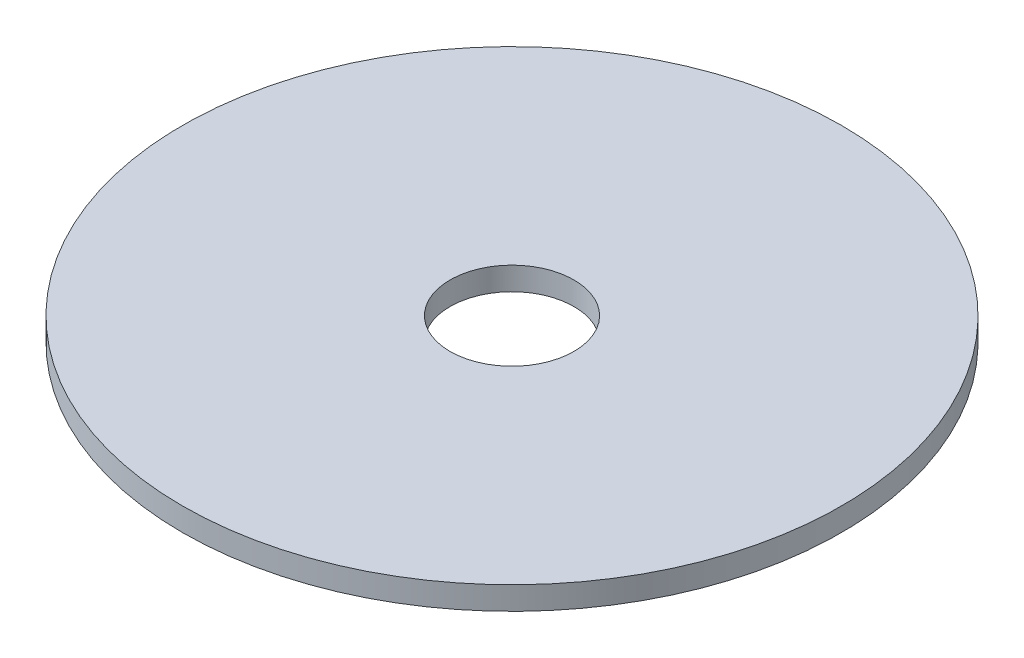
ISO-10303-21;
HEADER;
FILE_DESCRIPTION(('STEP AP214'),'2;1');
FILE_NAME('part.step','',(''),(''),'','','');
FILE_SCHEMA(('AUTOMOTIVE_DESIGN { 1 0 10303 214 1 1 1 1 }'));
ENDSEC;
DATA;
#1=APPLICATION_CONTEXT('core data for automotive mechanical design processes');
#2=APPLICATION_PROTOCOL_DEFINITION('international standard','automotive_design',2000,#1);
#3=PRODUCT_CONTEXT('',#1,'mechanical');
#4=PRODUCT('Part','Part','',(#3));
#5=PRODUCT_RELATED_PRODUCT_CATEGORY('part','',(#4));
#6=PRODUCT_DEFINITION_FORMATION('','',#4);
#7=PRODUCT_DEFINITION_CONTEXT('part definition',#1,'design');
#8=PRODUCT_DEFINITION('design','',#6,#7);
#9=PRODUCT_DEFINITION_SHAPE('','',#8);
#10=(LENGTH_UNIT() NAMED_UNIT(*) SI_UNIT(.MILLI.,.METRE.));
#11=(NAMED_UNIT(*) PLANE_ANGLE_UNIT() SI_UNIT($,.RADIAN.));
#12=(NAMED_UNIT(*) SI_UNIT($,.STERADIAN.) SOLID_ANGLE_UNIT());
#13=UNCERTAINTY_MEASURE_WITH_UNIT(LENGTH_MEASURE(1.E-05),#10,'distance_accuracy_value','');
#14=(GEOMETRIC_REPRESENTATION_CONTEXT(3) GLOBAL_UNCERTAINTY_ASSIGNED_CONTEXT((#13)) GLOBAL_UNIT_ASSIGNED_CONTEXT((#10,
#11,#12)) REPRESENTATION_CONTEXT('',''));
#15=CARTESIAN_POINT('',(0.,0.,0.));
#16=DIRECTION('',(0.,0.,1.));
#17=DIRECTION('',(1.,0.,0.));
#18=AXIS2_PLACEMENT_3D('',#15,#16,#17);
#19=CARTESIAN_POINT('',(0.,0.889,0.));
#20=DIRECTION('',(0.,-1.,0.));
#21=DIRECTION('',(0.,0.,-1.));
#22=AXIS2_PLACEMENT_3D('',#19,#20,#21);
#23=CYLINDRICAL_SURFACE('',#22,12.7);
#24=CARTESIAN_POINT('',(0.,0.889,0.));
#25=DIRECTION('',(0.,1.,0.));
#26=DIRECTION('',(0.,0.,1.));
#27=AXIS2_PLACEMENT_3D('',#24,#25,#26);
#28=CIRCLE('',#27,12.7);
#29=CARTESIAN_POINT('',(0.,0.889,12.7));
#30=VERTEX_POINT('',#29);
#31=EDGE_CURVE('E10',#30,#30,#28,.T.);
#32=ORIENTED_EDGE('',*,*,#31,.F.);
#33=EDGE_LOOP('',(#32));
#34=FACE_BOUND('',#33,.T.);
#35=CARTESIAN_POINT('',(0.,0.,0.));
#36=DIRECTION('',(0.,1.,0.));
#37=DIRECTION('',(0.,0.,1.));
#38=AXIS2_PLACEMENT_3D('',#35,#36,#37);
#39=CIRCLE('',#38,12.7);
#40=CARTESIAN_POINT('',(0.,0.,12.7));
#41=VERTEX_POINT('',#40);
#42=EDGE_CURVE('E33',#41,#41,#39,.T.);
#43=ORIENTED_EDGE('',*,*,#42,.T.);
#44=EDGE_LOOP('',(#43));
#45=FACE_BOUND('',#44,.T.);
#46=ADVANCED_FACE('F30',(#34,#45),#23,.T.);
#47=CARTESIAN_POINT('',(0.,0.889,0.));
#48=DIRECTION('',(0.,1.,0.));
#49=DIRECTION('',(0.,0.,1.));
#50=AXIS2_PLACEMENT_3D('',#47,#48,#49);
#51=PLANE('',#50);
#52=CARTESIAN_POINT('',(0.,0.889,0.));
#53=DIRECTION('',(0.,1.,0.));
#54=DIRECTION('',(0.,0.,1.));
#55=AXIS2_PLACEMENT_3D('',#52,#53,#54);
#56=CIRCLE('',#55,2.3876);
#57=CARTESIAN_POINT('',(0.,0.889,2.3876));
#58=VERTEX_POINT('',#57);
#59=EDGE_CURVE('E42',#58,#58,#56,.T.);
#60=ORIENTED_EDGE('',*,*,#59,.F.);
#61=EDGE_LOOP('',(#60));
#62=FACE_BOUND('',#61,.T.);
#63=ORIENTED_EDGE('',*,*,#31,.T.);
#64=EDGE_LOOP('',(#63));
#65=FACE_BOUND('',#64,.T.);
#66=ADVANCED_FACE('F57',(#62,#65),#51,.T.);
#67=CARTESIAN_POINT('',(0.,0.,0.));
#68=DIRECTION('',(0.,1.,0.));
#69=DIRECTION('',(0.,0.,1.));
#70=AXIS2_PLACEMENT_3D('',#67,#68,#69);
#71=PLANE('',#70);
#72=CARTESIAN_POINT('',(0.,0.,0.));
#73=DIRECTION('',(0.,1.,0.));
#74=DIRECTION('',(0.,0.,1.));
#75=AXIS2_PLACEMENT_3D('',#72,#73,#74);
#76=CIRCLE('',#75,2.3876);
#77=CARTESIAN_POINT('',(0.,0.,2.3876));
#78=VERTEX_POINT('',#77);
#79=EDGE_CURVE('E40',#78,#78,#76,.T.);
#80=ORIENTED_EDGE('',*,*,#79,.T.);
#81=EDGE_LOOP('',(#80));
#82=FACE_BOUND('',#81,.T.);
#83=ORIENTED_EDGE('',*,*,#42,.F.);
#84=EDGE_LOOP('',(#83));
#85=FACE_BOUND('',#84,.T.);
#86=ADVANCED_FACE('F48',(#82,#85),#71,.F.);
#87=CARTESIAN_POINT('',(0.,0.,0.));
#88=DIRECTION('',(0.,1.,0.));
#89=DIRECTION('',(0.,0.,1.));
#90=AXIS2_PLACEMENT_3D('',#87,#88,#89);
#91=CYLINDRICAL_SURFACE('',#90,2.3876);
#92=ORIENTED_EDGE('',*,*,#79,.F.);
#93=EDGE_LOOP('',(#92));
#94=FACE_BOUND('',#93,.T.);
#95=ORIENTED_EDGE('',*,*,#59,.T.);
#96=EDGE_LOOP('',(#95));
#97=FACE_BOUND('',#96,.T.);
#98=ADVANCED_FACE('F51',(#94,#97),#91,.F.);
#99=CLOSED_SHELL('',(#46,#66,#86,#98));
#100=MANIFOLD_SOLID_BREP('B2',#99);
#101=ADVANCED_BREP_SHAPE_REPRESENTATION('',(#18,#100),#14);
#102=SHAPE_DEFINITION_REPRESENTATION(#9,#101);
ENDSEC;
END-ISO-10303-21;
